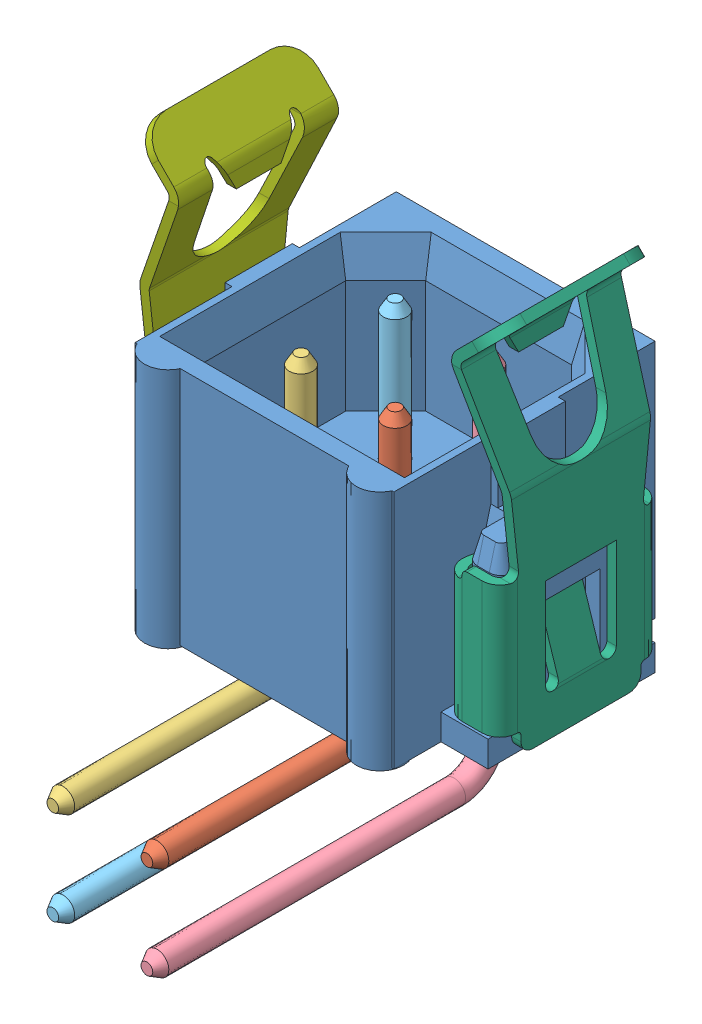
SolidWorks assembly m80-8510442_asm.SLDASM, configuration Default (file format 7000). Lengths in mm.
Overall size (7.9 11.1 9.05).
8 component instances, 7 part files, 0 mates.
Components (placement in the parent):
- M80-8680422-1: M80-8680422.sldasm [Default] at origin size (7.5 8.15 9.05)
  - M80-1020498_SEPARATE_ROWS-1: M80-1020498_SEPARATE_ROWS.sldprt [Default] at origin size (7.5 5.4 5.85)
  - M80-868-PIN1_3-1: M80-868-PIN1_3.sldprt [Default] at origin size (0.8 5.95 5.68)
  - M80-868-PIN1_1_1-1: M80-868-PIN1_1_1.sldprt [Default] at origin size (0.8 5.95 5.68)
  - M80-868-PIN2_3-1: M80-868-PIN2_3.sldprt [Default] at origin size (0.8 7.95 7.68)
  - M80-868-PIN2_1_1-1: M80-868-PIN2_1_1.sldprt [Default] at origin size (0.8 7.95 7.68)
- M80-001XXXX_2-1: M80-001XXXX_2.sldprt [Default] at origin size (1.2 7.95 3.45)
- M80-001XXXX_1_1-1: M80-001XXXX_1_1.sldprt [Default] at origin size (1.2 7.95 3.45)
